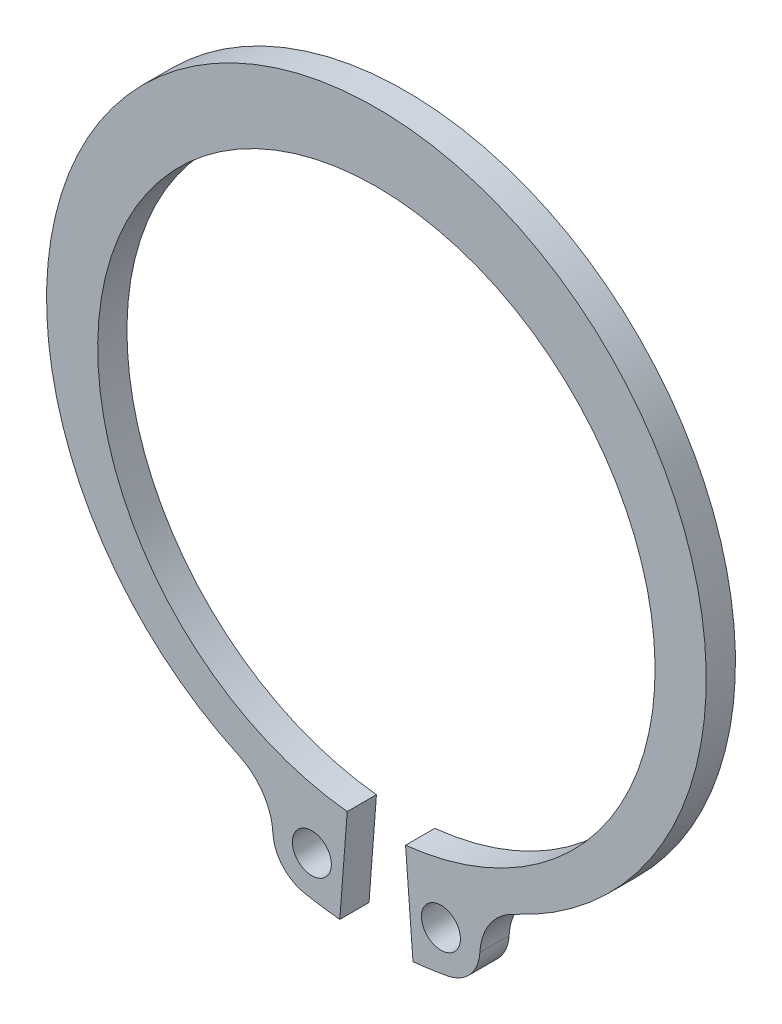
ISO-10303-21;
HEADER;
FILE_DESCRIPTION(('STEP AP214'),'2;1');
FILE_NAME('part.step','',(''),(''),'','','');
FILE_SCHEMA(('AUTOMOTIVE_DESIGN { 1 0 10303 214 1 1 1 1 }'));
ENDSEC;
DATA;
#1=APPLICATION_CONTEXT('core data for automotive mechanical design processes');
#2=APPLICATION_PROTOCOL_DEFINITION('international standard','automotive_design',2000,#1);
#3=PRODUCT_CONTEXT('',#1,'mechanical');
#4=PRODUCT('Part','Part','',(#3));
#5=PRODUCT_RELATED_PRODUCT_CATEGORY('part','',(#4));
#6=PRODUCT_DEFINITION_FORMATION('','',#4);
#7=PRODUCT_DEFINITION_CONTEXT('part definition',#1,'design');
#8=PRODUCT_DEFINITION('design','',#6,#7);
#9=PRODUCT_DEFINITION_SHAPE('','',#8);
#10=(LENGTH_UNIT() NAMED_UNIT(*) SI_UNIT(.MILLI.,.METRE.));
#11=(NAMED_UNIT(*) PLANE_ANGLE_UNIT() SI_UNIT($,.RADIAN.));
#12=(NAMED_UNIT(*) SI_UNIT($,.STERADIAN.) SOLID_ANGLE_UNIT());
#13=UNCERTAINTY_MEASURE_WITH_UNIT(LENGTH_MEASURE(1.E-05),#10,'distance_accuracy_value','');
#14=(GEOMETRIC_REPRESENTATION_CONTEXT(3) GLOBAL_UNCERTAINTY_ASSIGNED_CONTEXT((#13)) GLOBAL_UNIT_ASSIGNED_CONTEXT((#10,
#11,#12)) REPRESENTATION_CONTEXT('',''));
#15=CARTESIAN_POINT('',(0.,0.,0.));
#16=DIRECTION('',(0.,0.,1.));
#17=DIRECTION('',(1.,0.,0.));
#18=AXIS2_PLACEMENT_3D('',#15,#16,#17);
#19=CARTESIAN_POINT('',(0.,0.,1.5));
#20=DIRECTION('',(0.,0.,1.));
#21=DIRECTION('',(1.,0.,0.));
#22=AXIS2_PLACEMENT_3D('',#19,#20,#21);
#23=PLANE('',#22);
#24=CARTESIAN_POINT('',(-3.31198552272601,-16.9784583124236,1.5));
#25=DIRECTION('',(0.,0.,1.));
#26=DIRECTION('',(-1.,0.,0.));
#27=AXIS2_PLACEMENT_3D('',#24,#25,#26);
#28=CIRCLE('',#27,1.);
#29=CARTESIAN_POINT('',(-4.31198552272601,-16.9784583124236,1.5));
#30=VERTEX_POINT('',#29);
#31=EDGE_CURVE('E144',#30,#30,#28,.T.);
#32=ORIENTED_EDGE('',*,*,#31,.F.);
#33=EDGE_LOOP('',(#32));
#34=FACE_BOUND('',#33,.T.);
#35=CARTESIAN_POINT('',(0.,0.,1.5));
#36=DIRECTION('',(0.,0.,-1.));
#37=DIRECTION('',(1.,0.,0.));
#38=AXIS2_PLACEMENT_3D('',#35,#36,#37);
#39=CIRCLE('',#38,14.3);
#40=CARTESIAN_POINT('',(-1.49686515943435,-14.2214413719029,1.5));
#41=VERTEX_POINT('',#40);
#42=CARTESIAN_POINT('',(1.49686515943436,-14.2214413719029,1.5));
#43=VERTEX_POINT('',#42);
#44=EDGE_CURVE('E159',#41,#43,#39,.T.);
#45=ORIENTED_EDGE('',*,*,#44,.T.);
#46=DIRECTION('',(0.0761165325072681,-0.997098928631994,0.));
#47=VECTOR('',#46,1.);
#48=CARTESIAN_POINT('',(1.49686515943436,-14.2214413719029,1.5));
#49=LINE('',#48,#47);
#50=CARTESIAN_POINT('',(1.87744782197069,-19.2069360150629,1.5));
#51=VERTEX_POINT('',#50);
#52=EDGE_CURVE('E97',#43,#51,#49,.T.);
#53=ORIENTED_EDGE('',*,*,#52,.T.);
#54=CARTESIAN_POINT('',(0.,0.,1.5));
#55=DIRECTION('',(0.,0.,1.));
#56=DIRECTION('',(1.,0.,0.));
#57=AXIS2_PLACEMENT_3D('',#54,#55,#56);
#58=CIRCLE('',#57,19.2984766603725);
#59=CARTESIAN_POINT('',(3.69490774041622,-18.941458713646,1.5));
#60=VERTEX_POINT('',#59);
#61=EDGE_CURVE('E180',#51,#60,#58,.T.);
#62=ORIENTED_EDGE('',*,*,#61,.T.);
#63=CARTESIAN_POINT('',(3.31198552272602,-16.9784583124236,1.5));
#64=DIRECTION('',(0.,0.,1.));
#65=DIRECTION('',(1.,0.,0.));
#66=AXIS2_PLACEMENT_3D('',#63,#64,#65);
#67=CIRCLE('',#66,2.);
#68=CARTESIAN_POINT('',(5.30931985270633,-17.0816841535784,1.5));
#69=VERTEX_POINT('',#68);
#70=EDGE_CURVE('E199',#60,#69,#67,.T.);
#71=ORIENTED_EDGE('',*,*,#70,.T.);
#72=CARTESIAN_POINT('',(8.30532134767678,-17.2365229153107,1.5));
#73=DIRECTION('',(0.,0.,-1.));
#74=DIRECTION('',(1.,0.,0.));
#75=AXIS2_PLACEMENT_3D('',#72,#73,#74);
#76=CIRCLE('',#75,3.);
#77=CARTESIAN_POINT('',(7.0548338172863,-14.5095683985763,1.5));
#78=VERTEX_POINT('',#77);
#79=EDGE_CURVE('E196',#69,#78,#76,.T.);
#80=ORIENTED_EDGE('',*,*,#79,.T.);
#81=CARTESIAN_POINT('',(0.,0.875,1.5));
#82=DIRECTION('',(0.,0.,1.));
#83=DIRECTION('',(1.,0.,0.));
#84=AXIS2_PLACEMENT_3D('',#81,#82,#83);
#85=CIRCLE('',#84,16.925);
#86=CARTESIAN_POINT('',(-7.05483381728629,-14.5095683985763,1.5));
#87=VERTEX_POINT('',#86);
#88=EDGE_CURVE('E198',#78,#87,#85,.T.);
#89=ORIENTED_EDGE('',*,*,#88,.T.);
#90=CARTESIAN_POINT('',(-8.30532134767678,-17.2365229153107,1.5));
#91=DIRECTION('',(0.,0.,-1.));
#92=DIRECTION('',(-1.,0.,0.));
#93=AXIS2_PLACEMENT_3D('',#90,#91,#92);
#94=CIRCLE('',#93,3.);
#95=CARTESIAN_POINT('',(-5.30931985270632,-17.0816841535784,1.5));
#96=VERTEX_POINT('',#95);
#97=EDGE_CURVE('E122',#87,#96,#94,.T.);
#98=ORIENTED_EDGE('',*,*,#97,.T.);
#99=CARTESIAN_POINT('',(-3.31198552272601,-16.9784583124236,1.5));
#100=DIRECTION('',(0.,0.,1.));
#101=DIRECTION('',(-1.,0.,0.));
#102=AXIS2_PLACEMENT_3D('',#99,#100,#101);
#103=CIRCLE('',#102,2.);
#104=CARTESIAN_POINT('',(-3.69490774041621,-18.941458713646,1.5));
#105=VERTEX_POINT('',#104);
#106=EDGE_CURVE('E116',#96,#105,#103,.T.);
#107=ORIENTED_EDGE('',*,*,#106,.T.);
#108=CARTESIAN_POINT('',(0.,0.,1.5));
#109=DIRECTION('',(0.,0.,1.));
#110=DIRECTION('',(-1.,0.,0.));
#111=AXIS2_PLACEMENT_3D('',#108,#109,#110);
#112=CIRCLE('',#111,19.2984766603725);
#113=CARTESIAN_POINT('',(-1.87744782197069,-19.2069360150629,1.5));
#114=VERTEX_POINT('',#113);
#115=EDGE_CURVE('E120',#105,#114,#112,.T.);
#116=ORIENTED_EDGE('',*,*,#115,.T.);
#117=DIRECTION('',(0.0761165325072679,0.997098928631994,0.));
#118=VECTOR('',#117,1.);
#119=CARTESIAN_POINT('',(-1.49686515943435,-14.2214413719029,1.5));
#120=LINE('',#119,#118);
#121=EDGE_CURVE('E48',#114,#41,#120,.T.);
#122=ORIENTED_EDGE('',*,*,#121,.T.);
#123=EDGE_LOOP('',(#45,#53,#62,#71,#80,#89,#98,#107,#116,#122));
#124=FACE_BOUND('',#123,.T.);
#125=CARTESIAN_POINT('',(3.31198552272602,-16.9784583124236,1.5));
#126=DIRECTION('',(0.,0.,1.));
#127=DIRECTION('',(1.,0.,0.));
#128=AXIS2_PLACEMENT_3D('',#125,#126,#127);
#129=CIRCLE('',#128,1.);
#130=CARTESIAN_POINT('',(4.31198552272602,-16.9784583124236,1.5));
#131=VERTEX_POINT('',#130);
#132=EDGE_CURVE('E210',#131,#131,#129,.T.);
#133=ORIENTED_EDGE('',*,*,#132,.F.);
#134=EDGE_LOOP('',(#133));
#135=FACE_BOUND('',#134,.T.);
#136=ADVANCED_FACE('F31',(#34,#124,#135),#23,.T.);
#137=CARTESIAN_POINT('',(0.,0.,0.));
#138=DIRECTION('',(0.,0.,1.));
#139=DIRECTION('',(1.,0.,0.));
#140=AXIS2_PLACEMENT_3D('',#137,#138,#139);
#141=PLANE('',#140);
#142=CARTESIAN_POINT('',(-3.31198552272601,-16.9784583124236,0.));
#143=DIRECTION('',(0.,0.,1.));
#144=DIRECTION('',(-1.,0.,0.));
#145=AXIS2_PLACEMENT_3D('',#142,#143,#144);
#146=CIRCLE('',#145,1.);
#147=CARTESIAN_POINT('',(-4.31198552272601,-16.9784583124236,0.));
#148=VERTEX_POINT('',#147);
#149=EDGE_CURVE('E207',#148,#148,#146,.T.);
#150=ORIENTED_EDGE('',*,*,#149,.T.);
#151=EDGE_LOOP('',(#150));
#152=FACE_BOUND('',#151,.T.);
#153=CARTESIAN_POINT('',(0.,0.,0.));
#154=DIRECTION('',(0.,0.,-1.));
#155=DIRECTION('',(1.,0.,0.));
#156=AXIS2_PLACEMENT_3D('',#153,#154,#155);
#157=CIRCLE('',#156,14.3);
#158=CARTESIAN_POINT('',(-1.49686515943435,-14.2214413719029,0.));
#159=VERTEX_POINT('',#158);
#160=CARTESIAN_POINT('',(1.49686515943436,-14.2214413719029,0.));
#161=VERTEX_POINT('',#160);
#162=EDGE_CURVE('E140',#159,#161,#157,.T.);
#163=ORIENTED_EDGE('',*,*,#162,.F.);
#164=DIRECTION('',(0.0761165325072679,0.997098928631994,0.));
#165=VECTOR('',#164,1.);
#166=CARTESIAN_POINT('',(-1.49686515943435,-14.2214413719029,0.));
#167=LINE('',#166,#165);
#168=CARTESIAN_POINT('',(-1.87744782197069,-19.2069360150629,0.));
#169=VERTEX_POINT('',#168);
#170=EDGE_CURVE('E89',#169,#159,#167,.T.);
#171=ORIENTED_EDGE('',*,*,#170,.F.);
#172=CARTESIAN_POINT('',(0.,0.,0.));
#173=DIRECTION('',(0.,0.,1.));
#174=DIRECTION('',(-1.,0.,0.));
#175=AXIS2_PLACEMENT_3D('',#172,#173,#174);
#176=CIRCLE('',#175,19.2984766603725);
#177=CARTESIAN_POINT('',(-3.69490774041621,-18.941458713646,0.));
#178=VERTEX_POINT('',#177);
#179=EDGE_CURVE('E83',#178,#169,#176,.T.);
#180=ORIENTED_EDGE('',*,*,#179,.F.);
#181=CARTESIAN_POINT('',(-3.31198552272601,-16.9784583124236,0.));
#182=DIRECTION('',(0.,0.,1.));
#183=DIRECTION('',(-1.,0.,0.));
#184=AXIS2_PLACEMENT_3D('',#181,#182,#183);
#185=CIRCLE('',#184,2.);
#186=CARTESIAN_POINT('',(-5.30931985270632,-17.0816841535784,0.));
#187=VERTEX_POINT('',#186);
#188=EDGE_CURVE('E130',#187,#178,#185,.T.);
#189=ORIENTED_EDGE('',*,*,#188,.F.);
#190=CARTESIAN_POINT('',(-8.30532134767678,-17.2365229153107,0.));
#191=DIRECTION('',(0.,0.,-1.));
#192=DIRECTION('',(-1.,0.,0.));
#193=AXIS2_PLACEMENT_3D('',#190,#191,#192);
#194=CIRCLE('',#193,3.);
#195=CARTESIAN_POINT('',(-7.05483381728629,-14.5095683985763,0.));
#196=VERTEX_POINT('',#195);
#197=EDGE_CURVE('E154',#196,#187,#194,.T.);
#198=ORIENTED_EDGE('',*,*,#197,.F.);
#199=CARTESIAN_POINT('',(0.,0.875,0.));
#200=DIRECTION('',(0.,0.,1.));
#201=DIRECTION('',(1.,0.,0.));
#202=AXIS2_PLACEMENT_3D('',#199,#200,#201);
#203=CIRCLE('',#202,16.925);
#204=CARTESIAN_POINT('',(7.0548338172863,-14.5095683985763,0.));
#205=VERTEX_POINT('',#204);
#206=EDGE_CURVE('E152',#205,#196,#203,.T.);
#207=ORIENTED_EDGE('',*,*,#206,.F.);
#208=CARTESIAN_POINT('',(8.30532134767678,-17.2365229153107,0.));
#209=DIRECTION('',(0.,0.,-1.));
#210=DIRECTION('',(1.,0.,0.));
#211=AXIS2_PLACEMENT_3D('',#208,#209,#210);
#212=CIRCLE('',#211,3.);
#213=CARTESIAN_POINT('',(5.30931985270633,-17.0816841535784,0.));
#214=VERTEX_POINT('',#213);
#215=EDGE_CURVE('E150',#214,#205,#212,.T.);
#216=ORIENTED_EDGE('',*,*,#215,.F.);
#217=CARTESIAN_POINT('',(3.31198552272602,-16.9784583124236,0.));
#218=DIRECTION('',(0.,0.,1.));
#219=DIRECTION('',(1.,0.,0.));
#220=AXIS2_PLACEMENT_3D('',#217,#218,#219);
#221=CIRCLE('',#220,2.);
#222=CARTESIAN_POINT('',(3.69490774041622,-18.941458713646,0.));
#223=VERTEX_POINT('',#222);
#224=EDGE_CURVE('E148',#223,#214,#221,.T.);
#225=ORIENTED_EDGE('',*,*,#224,.F.);
#226=CARTESIAN_POINT('',(0.,0.,0.));
#227=DIRECTION('',(0.,0.,1.));
#228=DIRECTION('',(1.,0.,0.));
#229=AXIS2_PLACEMENT_3D('',#226,#227,#228);
#230=CIRCLE('',#229,19.2984766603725);
#231=CARTESIAN_POINT('',(1.87744782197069,-19.2069360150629,0.));
#232=VERTEX_POINT('',#231);
#233=EDGE_CURVE('E146',#232,#223,#230,.T.);
#234=ORIENTED_EDGE('',*,*,#233,.F.);
#235=DIRECTION('',(0.0761165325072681,-0.997098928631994,0.));
#236=VECTOR('',#235,1.);
#237=CARTESIAN_POINT('',(1.49686515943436,-14.2214413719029,0.));
#238=LINE('',#237,#236);
#239=EDGE_CURVE('E143',#161,#232,#238,.T.);
#240=ORIENTED_EDGE('',*,*,#239,.F.);
#241=EDGE_LOOP('',(#163,#171,#180,#189,#198,#207,#216,#225,#234,#240));
#242=FACE_BOUND('',#241,.T.);
#243=CARTESIAN_POINT('',(3.31198552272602,-16.9784583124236,0.));
#244=DIRECTION('',(0.,0.,1.));
#245=DIRECTION('',(1.,0.,0.));
#246=AXIS2_PLACEMENT_3D('',#243,#244,#245);
#247=CIRCLE('',#246,1.);
#248=CARTESIAN_POINT('',(4.31198552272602,-16.9784583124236,0.));
#249=VERTEX_POINT('',#248);
#250=EDGE_CURVE('E213',#249,#249,#247,.T.);
#251=ORIENTED_EDGE('',*,*,#250,.T.);
#252=EDGE_LOOP('',(#251));
#253=FACE_BOUND('',#252,.T.);
#254=ADVANCED_FACE('F184',(#152,#242,#253),#141,.F.);
#255=CARTESIAN_POINT('',(0.,0.,1.5));
#256=DIRECTION('',(0.,0.,-1.));
#257=DIRECTION('',(-1.,0.,0.));
#258=AXIS2_PLACEMENT_3D('',#255,#256,#257);
#259=CYLINDRICAL_SURFACE('',#258,14.3);
#260=ORIENTED_EDGE('',*,*,#162,.T.);
#261=DIRECTION('',(0.,0.,-1.));
#262=VECTOR('',#261,1.);
#263=CARTESIAN_POINT('',(1.49686515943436,-14.2214413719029,1.5));
#264=LINE('',#263,#262);
#265=EDGE_CURVE('E11',#43,#161,#264,.T.);
#266=ORIENTED_EDGE('',*,*,#265,.F.);
#267=ORIENTED_EDGE('',*,*,#44,.F.);
#268=DIRECTION('',(0.,0.,-1.));
#269=VECTOR('',#268,1.);
#270=CARTESIAN_POINT('',(-1.49686515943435,-14.2214413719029,1.5));
#271=LINE('',#270,#269);
#272=EDGE_CURVE('E136',#41,#159,#271,.T.);
#273=ORIENTED_EDGE('',*,*,#272,.T.);
#274=EDGE_LOOP('',(#260,#266,#267,#273));
#275=FACE_BOUND('',#274,.T.);
#276=ADVANCED_FACE('F33',(#275),#259,.F.);
#277=CARTESIAN_POINT('',(1.49686515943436,-14.2214413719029,1.5));
#278=DIRECTION('',(0.997098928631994,0.0761165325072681,0.));
#279=DIRECTION('',(-0.0761165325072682,0.997098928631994,0.));
#280=AXIS2_PLACEMENT_3D('',#277,#278,#279);
#281=PLANE('',#280);
#282=ORIENTED_EDGE('',*,*,#239,.T.);
#283=DIRECTION('',(0.,0.,-1.));
#284=VECTOR('',#283,1.);
#285=CARTESIAN_POINT('',(1.87744782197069,-19.2069360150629,1.5));
#286=LINE('',#285,#284);
#287=EDGE_CURVE('E40',#51,#232,#286,.T.);
#288=ORIENTED_EDGE('',*,*,#287,.F.);
#289=ORIENTED_EDGE('',*,*,#52,.F.);
#290=ORIENTED_EDGE('',*,*,#265,.T.);
#291=EDGE_LOOP('',(#282,#288,#289,#290));
#292=FACE_BOUND('',#291,.T.);
#293=ADVANCED_FACE('F254',(#292),#281,.F.);
#294=CARTESIAN_POINT('',(0.,0.,1.5));
#295=DIRECTION('',(0.,0.,-1.));
#296=DIRECTION('',(-1.,0.,0.));
#297=AXIS2_PLACEMENT_3D('',#294,#295,#296);
#298=CYLINDRICAL_SURFACE('',#297,19.2984766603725);
#299=ORIENTED_EDGE('',*,*,#233,.T.);
#300=DIRECTION('',(0.,0.,-1.));
#301=VECTOR('',#300,1.);
#302=CARTESIAN_POINT('',(3.69490774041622,-18.941458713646,1.5));
#303=LINE('',#302,#301);
#304=EDGE_CURVE('E172',#60,#223,#303,.T.);
#305=ORIENTED_EDGE('',*,*,#304,.F.);
#306=ORIENTED_EDGE('',*,*,#61,.F.);
#307=ORIENTED_EDGE('',*,*,#287,.T.);
#308=EDGE_LOOP('',(#299,#305,#306,#307));
#309=FACE_BOUND('',#308,.T.);
#310=ADVANCED_FACE('F178',(#309),#298,.T.);
#311=CARTESIAN_POINT('',(3.31198552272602,-16.9784583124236,1.5));
#312=DIRECTION('',(0.,0.,-1.));
#313=DIRECTION('',(-1.,0.,0.));
#314=AXIS2_PLACEMENT_3D('',#311,#312,#313);
#315=CYLINDRICAL_SURFACE('',#314,2.);
#316=ORIENTED_EDGE('',*,*,#224,.T.);
#317=DIRECTION('',(0.,0.,-1.));
#318=VECTOR('',#317,1.);
#319=CARTESIAN_POINT('',(5.30931985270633,-17.0816841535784,1.5));
#320=LINE('',#319,#318);
#321=EDGE_CURVE('E169',#69,#214,#320,.T.);
#322=ORIENTED_EDGE('',*,*,#321,.F.);
#323=ORIENTED_EDGE('',*,*,#70,.F.);
#324=ORIENTED_EDGE('',*,*,#304,.T.);
#325=EDGE_LOOP('',(#316,#322,#323,#324));
#326=FACE_BOUND('',#325,.T.);
#327=ADVANCED_FACE('F190',(#326),#315,.T.);
#328=CARTESIAN_POINT('',(8.30532134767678,-17.2365229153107,1.5));
#329=DIRECTION('',(0.,0.,-1.));
#330=DIRECTION('',(-1.,0.,0.));
#331=AXIS2_PLACEMENT_3D('',#328,#329,#330);
#332=CYLINDRICAL_SURFACE('',#331,3.);
#333=ORIENTED_EDGE('',*,*,#215,.T.);
#334=DIRECTION('',(0.,0.,-1.));
#335=VECTOR('',#334,1.);
#336=CARTESIAN_POINT('',(7.0548338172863,-14.5095683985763,1.5));
#337=LINE('',#336,#335);
#338=EDGE_CURVE('E166',#78,#205,#337,.T.);
#339=ORIENTED_EDGE('',*,*,#338,.F.);
#340=ORIENTED_EDGE('',*,*,#79,.F.);
#341=ORIENTED_EDGE('',*,*,#321,.T.);
#342=EDGE_LOOP('',(#333,#339,#340,#341));
#343=FACE_BOUND('',#342,.T.);
#344=ADVANCED_FACE('F194',(#343),#332,.F.);
#345=CARTESIAN_POINT('',(0.,0.875,1.5));
#346=DIRECTION('',(0.,0.,-1.));
#347=DIRECTION('',(-1.,0.,0.));
#348=AXIS2_PLACEMENT_3D('',#345,#346,#347);
#349=CYLINDRICAL_SURFACE('',#348,16.925);
#350=ORIENTED_EDGE('',*,*,#206,.T.);
#351=DIRECTION('',(0.,0.,-1.));
#352=VECTOR('',#351,1.);
#353=CARTESIAN_POINT('',(-7.05483381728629,-14.5095683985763,1.5));
#354=LINE('',#353,#352);
#355=EDGE_CURVE('E163',#87,#196,#354,.T.);
#356=ORIENTED_EDGE('',*,*,#355,.F.);
#357=ORIENTED_EDGE('',*,*,#88,.F.);
#358=ORIENTED_EDGE('',*,*,#338,.T.);
#359=EDGE_LOOP('',(#350,#356,#357,#358));
#360=FACE_BOUND('',#359,.T.);
#361=ADVANCED_FACE('F244',(#360),#349,.T.);
#362=CARTESIAN_POINT('',(-8.30532134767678,-17.2365229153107,1.5));
#363=DIRECTION('',(0.,0.,-1.));
#364=DIRECTION('',(-1.,0.,0.));
#365=AXIS2_PLACEMENT_3D('',#362,#363,#364);
#366=CYLINDRICAL_SURFACE('',#365,3.);
#367=ORIENTED_EDGE('',*,*,#197,.T.);
#368=DIRECTION('',(0.,0.,-1.));
#369=VECTOR('',#368,1.);
#370=CARTESIAN_POINT('',(-5.30931985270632,-17.0816841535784,1.5));
#371=LINE('',#370,#369);
#372=EDGE_CURVE('E131',#96,#187,#371,.T.);
#373=ORIENTED_EDGE('',*,*,#372,.F.);
#374=ORIENTED_EDGE('',*,*,#97,.F.);
#375=ORIENTED_EDGE('',*,*,#355,.T.);
#376=EDGE_LOOP('',(#367,#373,#374,#375));
#377=FACE_BOUND('',#376,.T.);
#378=ADVANCED_FACE('F241',(#377),#366,.F.);
#379=CARTESIAN_POINT('',(-3.31198552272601,-16.9784583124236,1.5));
#380=DIRECTION('',(0.,0.,-1.));
#381=DIRECTION('',(-1.,0.,0.));
#382=AXIS2_PLACEMENT_3D('',#379,#380,#381);
#383=CYLINDRICAL_SURFACE('',#382,2.);
#384=ORIENTED_EDGE('',*,*,#188,.T.);
#385=DIRECTION('',(0.,0.,-1.));
#386=VECTOR('',#385,1.);
#387=CARTESIAN_POINT('',(-3.69490774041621,-18.941458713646,1.5));
#388=LINE('',#387,#386);
#389=EDGE_CURVE('E127',#105,#178,#388,.T.);
#390=ORIENTED_EDGE('',*,*,#389,.F.);
#391=ORIENTED_EDGE('',*,*,#106,.F.);
#392=ORIENTED_EDGE('',*,*,#372,.T.);
#393=EDGE_LOOP('',(#384,#390,#391,#392));
#394=FACE_BOUND('',#393,.T.);
#395=ADVANCED_FACE('F128',(#394),#383,.T.);
#396=CARTESIAN_POINT('',(0.,0.,1.5));
#397=DIRECTION('',(0.,0.,-1.));
#398=DIRECTION('',(-1.,0.,0.));
#399=AXIS2_PLACEMENT_3D('',#396,#397,#398);
#400=CYLINDRICAL_SURFACE('',#399,19.2984766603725);
#401=ORIENTED_EDGE('',*,*,#179,.T.);
#402=DIRECTION('',(0.,0.,-1.));
#403=VECTOR('',#402,1.);
#404=CARTESIAN_POINT('',(-1.87744782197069,-19.2069360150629,1.5));
#405=LINE('',#404,#403);
#406=EDGE_CURVE('E132',#114,#169,#405,.T.);
#407=ORIENTED_EDGE('',*,*,#406,.F.);
#408=ORIENTED_EDGE('',*,*,#115,.F.);
#409=ORIENTED_EDGE('',*,*,#389,.T.);
#410=EDGE_LOOP('',(#401,#407,#408,#409));
#411=FACE_BOUND('',#410,.T.);
#412=ADVANCED_FACE('F134',(#411),#400,.T.);
#413=CARTESIAN_POINT('',(-1.49686515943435,-14.2214413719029,1.5));
#414=DIRECTION('',(-0.997098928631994,0.0761165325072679,0.));
#415=DIRECTION('',(-0.0761165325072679,-0.997098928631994,0.));
#416=AXIS2_PLACEMENT_3D('',#413,#414,#415);
#417=PLANE('',#416);
#418=ORIENTED_EDGE('',*,*,#170,.T.);
#419=ORIENTED_EDGE('',*,*,#272,.F.);
#420=ORIENTED_EDGE('',*,*,#121,.F.);
#421=ORIENTED_EDGE('',*,*,#406,.T.);
#422=EDGE_LOOP('',(#418,#419,#420,#421));
#423=FACE_BOUND('',#422,.T.);
#424=ADVANCED_FACE('F234',(#423),#417,.F.);
#425=CARTESIAN_POINT('',(-3.31198552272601,-16.9784583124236,1.5));
#426=DIRECTION('',(0.,0.,-1.));
#427=DIRECTION('',(-1.,0.,0.));
#428=AXIS2_PLACEMENT_3D('',#425,#426,#427);
#429=CYLINDRICAL_SURFACE('',#428,1.);
#430=ORIENTED_EDGE('',*,*,#31,.T.);
#431=EDGE_LOOP('',(#430));
#432=FACE_BOUND('',#431,.T.);
#433=ORIENTED_EDGE('',*,*,#149,.F.);
#434=EDGE_LOOP('',(#433));
#435=FACE_BOUND('',#434,.T.);
#436=ADVANCED_FACE('F231',(#432,#435),#429,.F.);
#437=CARTESIAN_POINT('',(3.31198552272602,-16.9784583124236,1.5));
#438=DIRECTION('',(0.,0.,-1.));
#439=DIRECTION('',(-1.,0.,0.));
#440=AXIS2_PLACEMENT_3D('',#437,#438,#439);
#441=CYLINDRICAL_SURFACE('',#440,1.);
#442=ORIENTED_EDGE('',*,*,#132,.T.);
#443=EDGE_LOOP('',(#442));
#444=FACE_BOUND('',#443,.T.);
#445=ORIENTED_EDGE('',*,*,#250,.F.);
#446=EDGE_LOOP('',(#445));
#447=FACE_BOUND('',#446,.T.);
#448=ADVANCED_FACE('F219',(#444,#447),#441,.F.);
#449=CLOSED_SHELL('',(#136,#254,#276,#293,#310,#327,#344,#361,#378,#395,#412,#424,#436,#448));
#450=MANIFOLD_SOLID_BREP('B2',#449);
#451=ADVANCED_BREP_SHAPE_REPRESENTATION('',(#18,#450),#14);
#452=SHAPE_DEFINITION_REPRESENTATION(#9,#451);
ENDSEC;
END-ISO-10303-21;
